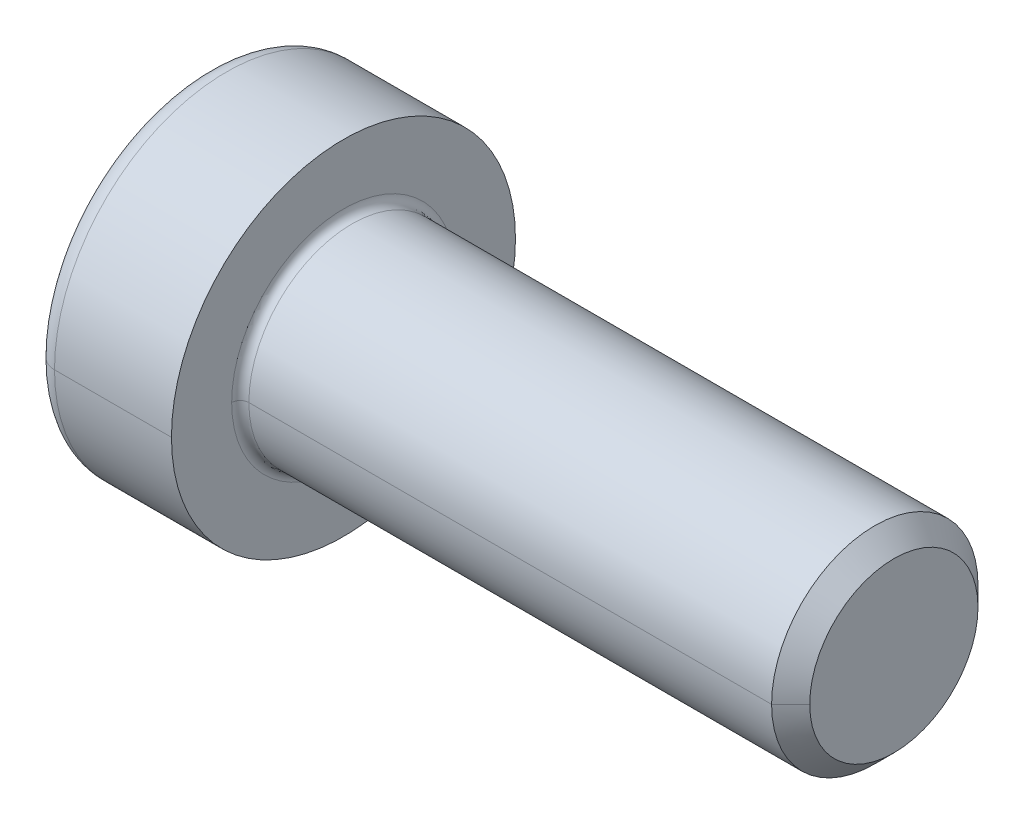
ISO-10303-21;
HEADER;
FILE_DESCRIPTION(('STEP AP214'),'2;1');
FILE_NAME('part.step','',(''),(''),'','','');
FILE_SCHEMA(('AUTOMOTIVE_DESIGN { 1 0 10303 214 1 1 1 1 }'));
ENDSEC;
DATA;
#1=APPLICATION_CONTEXT('core data for automotive mechanical design processes');
#2=APPLICATION_PROTOCOL_DEFINITION('international standard','automotive_design',2000,#1);
#3=PRODUCT_CONTEXT('',#1,'mechanical');
#4=PRODUCT('Part','Part','',(#3));
#5=PRODUCT_RELATED_PRODUCT_CATEGORY('part','',(#4));
#6=PRODUCT_DEFINITION_FORMATION('','',#4);
#7=PRODUCT_DEFINITION_CONTEXT('part definition',#1,'design');
#8=PRODUCT_DEFINITION('design','',#6,#7);
#9=PRODUCT_DEFINITION_SHAPE('','',#8);
#10=(LENGTH_UNIT() NAMED_UNIT(*) SI_UNIT(.MILLI.,.METRE.));
#11=(NAMED_UNIT(*) PLANE_ANGLE_UNIT() SI_UNIT($,.RADIAN.));
#12=(NAMED_UNIT(*) SI_UNIT($,.STERADIAN.) SOLID_ANGLE_UNIT());
#13=UNCERTAINTY_MEASURE_WITH_UNIT(LENGTH_MEASURE(1.E-05),#10,'distance_accuracy_value','');
#14=(GEOMETRIC_REPRESENTATION_CONTEXT(3) GLOBAL_UNCERTAINTY_ASSIGNED_CONTEXT((#13)) GLOBAL_UNIT_ASSIGNED_CONTEXT((#10,
#11,#12)) REPRESENTATION_CONTEXT('',''));
#15=CARTESIAN_POINT('',(0.,0.,0.));
#16=DIRECTION('',(0.,0.,1.));
#17=DIRECTION('',(1.,0.,0.));
#18=AXIS2_PLACEMENT_3D('',#15,#16,#17);
#19=CARTESIAN_POINT('',(-25.4127162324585,1.46192355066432,0.543791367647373));
#20=DIRECTION('',(-1.,0.,0.));
#21=DIRECTION('',(0.,0.,1.));
#22=AXIS2_PLACEMENT_3D('',#19,#20,#21);
#23=CONICAL_SURFACE('',#22,1.5,1.0471975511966);
#24=DIRECTION('',(-0.5,0.,-0.866025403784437));
#25=VECTOR('',#24,1.);
#26=CARTESIAN_POINT('',(-25.4127162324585,1.46192355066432,-0.956208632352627));
#27=LINE('',#26,#25);
#28=CARTESIAN_POINT('',(-24.546690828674,1.46192355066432,0.543791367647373));
#29=VERTEX_POINT('',#28);
#30=CARTESIAN_POINT('',(-25.4127162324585,1.46192355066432,-0.956208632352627));
#31=VERTEX_POINT('',#30);
#32=EDGE_CURVE('E449',#29,#31,#27,.T.);
#33=ORIENTED_EDGE('',*,*,#32,.F.);
#34=DIRECTION('',(-0.5,0.,0.866025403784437));
#35=VECTOR('',#34,1.);
#36=CARTESIAN_POINT('',(-25.4127162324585,1.46192355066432,2.04379136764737));
#37=LINE('',#36,#35);
#38=CARTESIAN_POINT('',(-25.4127162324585,1.46192355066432,2.04379136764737));
#39=VERTEX_POINT('',#38);
#40=EDGE_CURVE('E498',#29,#39,#37,.T.);
#41=ORIENTED_EDGE('',*,*,#40,.T.);
#42=CARTESIAN_POINT('',(-25.4127162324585,1.46192355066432,0.543791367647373));
#43=DIRECTION('',(-1.,0.,0.));
#44=DIRECTION('',(0.,0.,1.));
#45=AXIS2_PLACEMENT_3D('',#42,#43,#44);
#46=CIRCLE('',#45,1.5);
#47=EDGE_CURVE('E10',#39,#31,#46,.T.);
#48=ORIENTED_EDGE('',*,*,#47,.T.);
#49=EDGE_LOOP('',(#33,#41,#48));
#50=FACE_BOUND('',#49,.T.);
#51=ADVANCED_FACE('F15',(#50),#23,.F.);
#52=CARTESIAN_POINT('',(-30.4127162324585,1.46192355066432,0.543791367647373));
#53=DIRECTION('',(-1.,0.,0.));
#54=DIRECTION('',(0.,0.,1.));
#55=AXIS2_PLACEMENT_3D('',#52,#53,#54);
#56=CYLINDRICAL_SURFACE('',#55,1.5);
#57=DIRECTION('',(-1.,0.,0.));
#58=VECTOR('',#57,1.);
#59=CARTESIAN_POINT('',(-30.4127162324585,1.46192355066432,-0.956208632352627));
#60=LINE('',#59,#58);
#61=CARTESIAN_POINT('',(-27.3353659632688,1.46192355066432,-0.956208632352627));
#62=VERTEX_POINT('',#61);
#63=EDGE_CURVE('E251',#31,#62,#60,.T.);
#64=ORIENTED_EDGE('',*,*,#63,.F.);
#65=ORIENTED_EDGE('',*,*,#47,.F.);
#66=DIRECTION('',(-1.,0.,0.));
#67=VECTOR('',#66,1.);
#68=CARTESIAN_POINT('',(-30.4127162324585,1.46192355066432,2.04379136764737));
#69=LINE('',#68,#67);
#70=CARTESIAN_POINT('',(-27.3353659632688,1.46192355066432,2.04379136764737));
#71=VERTEX_POINT('',#70);
#72=EDGE_CURVE('E250',#39,#71,#69,.T.);
#73=ORIENTED_EDGE('',*,*,#72,.T.);
#74=CARTESIAN_POINT('',(-27.3353659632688,1.46192355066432,0.543791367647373));
#75=DIRECTION('',(-1.,0.,0.));
#76=DIRECTION('',(0.,0.,1.));
#77=AXIS2_PLACEMENT_3D('',#74,#75,#76);
#78=CIRCLE('',#77,1.5);
#79=EDGE_CURVE('E18',#71,#62,#78,.T.);
#80=ORIENTED_EDGE('',*,*,#79,.T.);
#81=EDGE_LOOP('',(#64,#65,#73,#80));
#82=FACE_BOUND('',#81,.T.);
#83=ADVANCED_FACE('F491',(#82),#56,.F.);
#84=CARTESIAN_POINT('',(-27.9127162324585,1.46192355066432,0.543791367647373));
#85=DIRECTION('',(-1.,0.,0.));
#86=DIRECTION('',(0.,0.,1.));
#87=AXIS2_PLACEMENT_3D('',#84,#85,#86);
#88=CONICAL_SURFACE('',#87,2.5,1.0471975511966);
#89=DIRECTION('',(-0.5,0.,-0.866025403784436));
#90=VECTOR('',#89,1.);
#91=CARTESIAN_POINT('',(-27.9127162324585,1.46192355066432,-1.95620863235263));
#92=LINE('',#91,#90);
#93=CARTESIAN_POINT('',(-27.9127162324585,1.46192355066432,-1.95620863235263));
#94=VERTEX_POINT('',#93);
#95=EDGE_CURVE('E260',#62,#94,#92,.T.);
#96=ORIENTED_EDGE('',*,*,#95,.F.);
#97=ORIENTED_EDGE('',*,*,#79,.F.);
#98=DIRECTION('',(-0.5,0.,0.866025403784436));
#99=VECTOR('',#98,1.);
#100=CARTESIAN_POINT('',(-27.9127162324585,1.46192355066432,3.04379136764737));
#101=LINE('',#100,#99);
#102=CARTESIAN_POINT('',(-27.9127162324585,1.46192355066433,3.04379136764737));
#103=VERTEX_POINT('',#102);
#104=EDGE_CURVE('E221',#71,#103,#101,.T.);
#105=ORIENTED_EDGE('',*,*,#104,.T.);
#106=CARTESIAN_POINT('',(-27.9127162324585,1.46192355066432,0.543791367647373));
#107=DIRECTION('',(-1.,0.,0.));
#108=DIRECTION('',(0.,0.,1.));
#109=AXIS2_PLACEMENT_3D('',#106,#107,#108);
#110=CIRCLE('',#109,2.5);
#111=CARTESIAN_POINT('',(-27.9127162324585,3.62698706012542,1.79379136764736));
#112=VERTEX_POINT('',#111);
#113=EDGE_CURVE('E210',#103,#112,#110,.T.);
#114=ORIENTED_EDGE('',*,*,#113,.T.);
#115=CARTESIAN_POINT('',(-27.9127162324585,1.46192355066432,0.543791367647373));
#116=DIRECTION('',(-1.,0.,0.));
#117=DIRECTION('',(0.,0.,1.));
#118=AXIS2_PLACEMENT_3D('',#115,#116,#117);
#119=CIRCLE('',#118,2.5);
#120=CARTESIAN_POINT('',(-27.9127162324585,3.62698706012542,-0.70620863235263));
#121=VERTEX_POINT('',#120);
#122=EDGE_CURVE('E355',#112,#121,#119,.T.);
#123=ORIENTED_EDGE('',*,*,#122,.T.);
#124=CARTESIAN_POINT('',(-27.9127162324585,1.46192355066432,0.543791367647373));
#125=DIRECTION('',(-1.,0.,0.));
#126=DIRECTION('',(0.,0.,1.));
#127=AXIS2_PLACEMENT_3D('',#124,#125,#126);
#128=CIRCLE('',#127,2.5);
#129=EDGE_CURVE('E298',#121,#94,#128,.T.);
#130=ORIENTED_EDGE('',*,*,#129,.T.);
#131=EDGE_LOOP('',(#96,#97,#105,#114,#123,#130));
#132=FACE_BOUND('',#131,.T.);
#133=ADVANCED_FACE('F223',(#132),#88,.F.);
#134=CARTESIAN_POINT('',(-27.9127162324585,2.9052992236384,3.04379136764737));
#135=DIRECTION('',(-1.,0.,0.));
#136=DIRECTION('',(0.,0.,1.));
#137=AXIS2_PLACEMENT_3D('',#134,#135,#136);
#138=PLANE('',#137);
#139=CARTESIAN_POINT('',(-27.9127162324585,1.46192355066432,0.543791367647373));
#140=DIRECTION('',(-1.,0.,0.));
#141=DIRECTION('',(0.,0.,1.));
#142=AXIS2_PLACEMENT_3D('',#139,#140,#141);
#143=CIRCLE('',#142,2.5);
#144=CARTESIAN_POINT('',(-27.9127162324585,-0.703139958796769,1.79379136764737));
#145=VERTEX_POINT('',#144);
#146=EDGE_CURVE('E192',#145,#103,#143,.T.);
#147=ORIENTED_EDGE('',*,*,#146,.F.);
#148=DIRECTION('',(0.,-0.5,-0.866025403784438));
#149=VECTOR('',#148,1.);
#150=CARTESIAN_POINT('',(-27.9127162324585,0.0185478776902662,3.04379136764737));
#151=LINE('',#150,#149);
#152=CARTESIAN_POINT('',(-27.9127162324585,0.0185478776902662,3.04379136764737));
#153=VERTEX_POINT('',#152);
#154=EDGE_CURVE('E37',#153,#145,#151,.T.);
#155=ORIENTED_EDGE('',*,*,#154,.F.);
#156=DIRECTION('',(0.,1.,0.));
#157=VECTOR('',#156,1.);
#158=CARTESIAN_POINT('',(-27.9127162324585,0.0185478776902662,3.04379136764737));
#159=LINE('',#158,#157);
#160=EDGE_CURVE('E188',#153,#103,#159,.T.);
#161=ORIENTED_EDGE('',*,*,#160,.T.);
#162=EDGE_LOOP('',(#147,#155,#161));
#163=FACE_BOUND('',#162,.T.);
#164=ADVANCED_FACE('F190',(#163),#138,.T.);
#165=CARTESIAN_POINT('',(-27.9127162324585,4.34867489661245,0.543791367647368));
#166=DIRECTION('',(0.,0.866025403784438,-0.5));
#167=DIRECTION('',(-1.,0.,0.));
#168=AXIS2_PLACEMENT_3D('',#165,#166,#167);
#169=PLANE('',#168);
#170=DIRECTION('',(0.,-0.5,-0.866025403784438));
#171=VECTOR('',#170,1.);
#172=CARTESIAN_POINT('',(-27.9127162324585,4.34867489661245,0.543791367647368));
#173=LINE('',#172,#171);
#174=CARTESIAN_POINT('',(-27.9127162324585,2.90529922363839,-1.95620863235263));
#175=VERTEX_POINT('',#174);
#176=EDGE_CURVE('E294',#121,#175,#173,.T.);
#177=ORIENTED_EDGE('',*,*,#176,.F.);
#178=DIRECTION('',(0.,-0.5,-0.866025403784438));
#179=VECTOR('',#178,1.);
#180=CARTESIAN_POINT('',(-27.9127162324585,4.34867489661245,0.543791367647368));
#181=LINE('',#180,#179);
#182=CARTESIAN_POINT('',(-27.9127162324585,4.34867489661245,0.543791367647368));
#183=VERTEX_POINT('',#182);
#184=EDGE_CURVE('E324',#183,#121,#181,.T.);
#185=ORIENTED_EDGE('',*,*,#184,.F.);
#186=DIRECTION('',(-1.,0.,0.));
#187=VECTOR('',#186,1.);
#188=CARTESIAN_POINT('',(-27.9127162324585,4.34867489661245,0.543791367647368));
#189=LINE('',#188,#187);
#190=CARTESIAN_POINT('',(-30.4127162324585,4.34867489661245,0.543791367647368));
#191=VERTEX_POINT('',#190);
#192=EDGE_CURVE('E197',#183,#191,#189,.T.);
#193=ORIENTED_EDGE('',*,*,#192,.T.);
#194=DIRECTION('',(0.,-0.5,-0.866025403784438));
#195=VECTOR('',#194,1.);
#196=CARTESIAN_POINT('',(-30.4127162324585,4.34867489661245,0.543791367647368));
#197=LINE('',#196,#195);
#198=CARTESIAN_POINT('',(-30.4127162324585,2.90529922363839,-1.95620863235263));
#199=VERTEX_POINT('',#198);
#200=EDGE_CURVE('E283',#191,#199,#197,.T.);
#201=ORIENTED_EDGE('',*,*,#200,.T.);
#202=DIRECTION('',(-1.,0.,0.));
#203=VECTOR('',#202,1.);
#204=CARTESIAN_POINT('',(-27.9127162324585,2.90529922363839,-1.95620863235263));
#205=LINE('',#204,#203);
#206=EDGE_CURVE('E266',#175,#199,#205,.T.);
#207=ORIENTED_EDGE('',*,*,#206,.F.);
#208=EDGE_LOOP('',(#177,#185,#193,#201,#207));
#209=FACE_BOUND('',#208,.T.);
#210=ADVANCED_FACE('F839',(#209),#169,.F.);
#211=CARTESIAN_POINT('',(-27.9127162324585,2.90529922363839,-1.95620863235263));
#212=DIRECTION('',(0.,0.,-1.));
#213=DIRECTION('',(0.,-1.,0.));
#214=AXIS2_PLACEMENT_3D('',#211,#212,#213);
#215=PLANE('',#214);
#216=DIRECTION('',(0.,-1.,0.));
#217=VECTOR('',#216,1.);
#218=CARTESIAN_POINT('',(-27.9127162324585,2.90529922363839,-1.95620863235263));
#219=LINE('',#218,#217);
#220=CARTESIAN_POINT('',(-27.9127162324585,0.0185478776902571,-1.95620863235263));
#221=VERTEX_POINT('',#220);
#222=EDGE_CURVE('E367',#94,#221,#219,.T.);
#223=ORIENTED_EDGE('',*,*,#222,.F.);
#224=DIRECTION('',(0.,-1.,0.));
#225=VECTOR('',#224,1.);
#226=CARTESIAN_POINT('',(-27.9127162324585,2.90529922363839,-1.95620863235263));
#227=LINE('',#226,#225);
#228=EDGE_CURVE('E297',#175,#94,#227,.T.);
#229=ORIENTED_EDGE('',*,*,#228,.F.);
#230=ORIENTED_EDGE('',*,*,#206,.T.);
#231=DIRECTION('',(0.,-1.,0.));
#232=VECTOR('',#231,1.);
#233=CARTESIAN_POINT('',(-30.4127162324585,2.90529922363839,-1.95620863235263));
#234=LINE('',#233,#232);
#235=CARTESIAN_POINT('',(-30.4127162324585,0.0185478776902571,-1.95620863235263));
#236=VERTEX_POINT('',#235);
#237=EDGE_CURVE('E271',#199,#236,#234,.T.);
#238=ORIENTED_EDGE('',*,*,#237,.T.);
#239=DIRECTION('',(-1.,0.,0.));
#240=VECTOR('',#239,1.);
#241=CARTESIAN_POINT('',(-27.9127162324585,0.0185478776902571,-1.95620863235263));
#242=LINE('',#241,#240);
#243=EDGE_CURVE('E48',#221,#236,#242,.T.);
#244=ORIENTED_EDGE('',*,*,#243,.F.);
#245=EDGE_LOOP('',(#223,#229,#230,#238,#244));
#246=FACE_BOUND('',#245,.T.);
#247=ADVANCED_FACE('F835',(#246),#215,.F.);
#248=CARTESIAN_POINT('',(-27.9127162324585,-1.4248277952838,0.543791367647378));
#249=DIRECTION('',(0.,0.86602540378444,0.5));
#250=DIRECTION('',(1.,0.,0.));
#251=AXIS2_PLACEMENT_3D('',#248,#249,#250);
#252=PLANE('',#251);
#253=ORIENTED_EDGE('',*,*,#243,.T.);
#254=DIRECTION('',(0.,0.5,-0.86602540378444));
#255=VECTOR('',#254,1.);
#256=CARTESIAN_POINT('',(-30.4127162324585,-1.4248277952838,0.543791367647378));
#257=LINE('',#256,#255);
#258=CARTESIAN_POINT('',(-30.4127162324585,-1.4248277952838,0.543791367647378));
#259=VERTEX_POINT('',#258);
#260=EDGE_CURVE('E352',#259,#236,#257,.T.);
#261=ORIENTED_EDGE('',*,*,#260,.F.);
#262=DIRECTION('',(-1.,0.,0.));
#263=VECTOR('',#262,1.);
#264=CARTESIAN_POINT('',(-27.9127162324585,-1.4248277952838,0.543791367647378));
#265=LINE('',#264,#263);
#266=CARTESIAN_POINT('',(-27.9127162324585,-1.4248277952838,0.543791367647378));
#267=VERTEX_POINT('',#266);
#268=EDGE_CURVE('E339',#267,#259,#265,.T.);
#269=ORIENTED_EDGE('',*,*,#268,.F.);
#270=DIRECTION('',(0.,0.5,-0.86602540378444));
#271=VECTOR('',#270,1.);
#272=CARTESIAN_POINT('',(-27.9127162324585,-1.4248277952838,0.543791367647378));
#273=LINE('',#272,#271);
#274=CARTESIAN_POINT('',(-27.9127162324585,-0.703139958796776,-0.706208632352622));
#275=VERTEX_POINT('',#274);
#276=EDGE_CURVE('E371',#267,#275,#273,.T.);
#277=ORIENTED_EDGE('',*,*,#276,.T.);
#278=DIRECTION('',(0.,0.5,-0.86602540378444));
#279=VECTOR('',#278,1.);
#280=CARTESIAN_POINT('',(-27.9127162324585,-1.4248277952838,0.543791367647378));
#281=LINE('',#280,#279);
#282=EDGE_CURVE('E368',#275,#221,#281,.T.);
#283=ORIENTED_EDGE('',*,*,#282,.T.);
#284=EDGE_LOOP('',(#253,#261,#269,#277,#283));
#285=FACE_BOUND('',#284,.T.);
#286=ADVANCED_FACE('F765',(#285),#252,.T.);
#287=CARTESIAN_POINT('',(-27.9127162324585,0.0185478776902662,3.04379136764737));
#288=DIRECTION('',(0.,0.866025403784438,-0.5));
#289=DIRECTION('',(-1.,0.,0.));
#290=AXIS2_PLACEMENT_3D('',#287,#288,#289);
#291=PLANE('',#290);
#292=ORIENTED_EDGE('',*,*,#268,.T.);
#293=DIRECTION('',(0.,-0.5,-0.866025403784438));
#294=VECTOR('',#293,1.);
#295=CARTESIAN_POINT('',(-30.4127162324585,0.0185478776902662,3.04379136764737));
#296=LINE('',#295,#294);
#297=CARTESIAN_POINT('',(-30.4127162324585,0.0185478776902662,3.04379136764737));
#298=VERTEX_POINT('',#297);
#299=EDGE_CURVE('E389',#298,#259,#296,.T.);
#300=ORIENTED_EDGE('',*,*,#299,.F.);
#301=DIRECTION('',(-1.,0.,0.));
#302=VECTOR('',#301,1.);
#303=CARTESIAN_POINT('',(-27.9127162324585,0.0185478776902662,3.04379136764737));
#304=LINE('',#303,#302);
#305=EDGE_CURVE('E196',#153,#298,#304,.T.);
#306=ORIENTED_EDGE('',*,*,#305,.F.);
#307=ORIENTED_EDGE('',*,*,#154,.T.);
#308=DIRECTION('',(0.,-0.5,-0.866025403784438));
#309=VECTOR('',#308,1.);
#310=CARTESIAN_POINT('',(-27.9127162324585,0.0185478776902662,3.04379136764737));
#311=LINE('',#310,#309);
#312=EDGE_CURVE('E376',#145,#267,#311,.T.);
#313=ORIENTED_EDGE('',*,*,#312,.T.);
#314=EDGE_LOOP('',(#292,#300,#306,#307,#313));
#315=FACE_BOUND('',#314,.T.);
#316=ADVANCED_FACE('F414',(#315),#291,.T.);
#317=CARTESIAN_POINT('',(-27.9127162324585,0.0185478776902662,3.04379136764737));
#318=DIRECTION('',(0.,0.,1.));
#319=DIRECTION('',(0.,-1.,0.));
#320=AXIS2_PLACEMENT_3D('',#317,#318,#319);
#321=PLANE('',#320);
#322=DIRECTION('',(0.,1.,0.));
#323=VECTOR('',#322,1.);
#324=CARTESIAN_POINT('',(-27.9127162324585,0.0185478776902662,3.04379136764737));
#325=LINE('',#324,#323);
#326=CARTESIAN_POINT('',(-27.9127162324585,2.9052992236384,3.04379136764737));
#327=VERTEX_POINT('',#326);
#328=EDGE_CURVE('E200',#103,#327,#325,.T.);
#329=ORIENTED_EDGE('',*,*,#328,.F.);
#330=ORIENTED_EDGE('',*,*,#160,.F.);
#331=ORIENTED_EDGE('',*,*,#305,.T.);
#332=DIRECTION('',(0.,1.,0.));
#333=VECTOR('',#332,1.);
#334=CARTESIAN_POINT('',(-30.4127162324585,0.0185478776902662,3.04379136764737));
#335=LINE('',#334,#333);
#336=CARTESIAN_POINT('',(-30.4127162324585,2.9052992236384,3.04379136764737));
#337=VERTEX_POINT('',#336);
#338=EDGE_CURVE('E282',#298,#337,#335,.T.);
#339=ORIENTED_EDGE('',*,*,#338,.T.);
#340=DIRECTION('',(-1.,0.,0.));
#341=VECTOR('',#340,1.);
#342=CARTESIAN_POINT('',(-27.9127162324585,2.9052992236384,3.04379136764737));
#343=LINE('',#342,#341);
#344=EDGE_CURVE('E204',#327,#337,#343,.T.);
#345=ORIENTED_EDGE('',*,*,#344,.F.);
#346=EDGE_LOOP('',(#329,#330,#331,#339,#345));
#347=FACE_BOUND('',#346,.T.);
#348=ADVANCED_FACE('F202',(#347),#321,.F.);
#349=CARTESIAN_POINT('',(-27.9127162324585,4.34867489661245,0.543791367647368));
#350=DIRECTION('',(0.,-0.86602540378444,-0.5));
#351=DIRECTION('',(0.,0.5,-0.86602540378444));
#352=AXIS2_PLACEMENT_3D('',#349,#350,#351);
#353=PLANE('',#352);
#354=ORIENTED_EDGE('',*,*,#344,.T.);
#355=DIRECTION('',(0.,-0.5,0.86602540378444));
#356=VECTOR('',#355,1.);
#357=CARTESIAN_POINT('',(-30.4127162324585,4.34867489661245,0.543791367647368));
#358=LINE('',#357,#356);
#359=EDGE_CURVE('E278',#191,#337,#358,.T.);
#360=ORIENTED_EDGE('',*,*,#359,.F.);
#361=ORIENTED_EDGE('',*,*,#192,.F.);
#362=DIRECTION('',(0.,-0.5,0.86602540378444));
#363=VECTOR('',#362,1.);
#364=CARTESIAN_POINT('',(-27.9127162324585,4.34867489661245,0.543791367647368));
#365=LINE('',#364,#363);
#366=EDGE_CURVE('E358',#183,#112,#365,.T.);
#367=ORIENTED_EDGE('',*,*,#366,.T.);
#368=DIRECTION('',(0.,-0.5,0.86602540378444));
#369=VECTOR('',#368,1.);
#370=CARTESIAN_POINT('',(-27.9127162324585,4.34867489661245,0.543791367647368));
#371=LINE('',#370,#369);
#372=EDGE_CURVE('E209',#112,#327,#371,.T.);
#373=ORIENTED_EDGE('',*,*,#372,.T.);
#374=EDGE_LOOP('',(#354,#360,#361,#367,#373));
#375=FACE_BOUND('',#374,.T.);
#376=ADVANCED_FACE('F422',(#375),#353,.T.);
#377=CARTESIAN_POINT('',(-29.8127162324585,1.46192355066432,0.543791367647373));
#378=DIRECTION('',(-1.,0.,0.));
#379=DIRECTION('',(0.,0.,1.));
#380=AXIS2_PLACEMENT_3D('',#377,#378,#379);
#381=TOROIDAL_SURFACE('',#380,4.4,0.6);
#382=CARTESIAN_POINT('',(-29.8127162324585,1.46192355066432,-3.85620863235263));
#383=DIRECTION('',(0.,1.,0.));
#384=DIRECTION('',(0.,0.,1.));
#385=AXIS2_PLACEMENT_3D('',#382,#383,#384);
#386=CIRCLE('',#385,0.6);
#387=CARTESIAN_POINT('',(-29.8127162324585,1.46192355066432,-4.45620863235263));
#388=VERTEX_POINT('',#387);
#389=CARTESIAN_POINT('',(-30.4127162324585,1.46192355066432,-3.85620863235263));
#390=VERTEX_POINT('',#389);
#391=EDGE_CURVE('E284',#388,#390,#386,.T.);
#392=ORIENTED_EDGE('',*,*,#391,.F.);
#393=CARTESIAN_POINT('',(-29.8127162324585,1.46192355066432,0.543791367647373));
#394=DIRECTION('',(1.,0.,0.));
#395=DIRECTION('',(0.,0.,1.));
#396=AXIS2_PLACEMENT_3D('',#393,#394,#395);
#397=CIRCLE('',#396,5.);
#398=CARTESIAN_POINT('',(-29.8127162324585,1.46192355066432,5.54379136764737));
#399=VERTEX_POINT('',#398);
#400=EDGE_CURVE('E270',#399,#388,#397,.T.);
#401=ORIENTED_EDGE('',*,*,#400,.F.);
#402=CARTESIAN_POINT('',(-29.8127162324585,1.46192355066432,4.94379136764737));
#403=DIRECTION('',(0.,-1.,0.));
#404=DIRECTION('',(0.,0.,-1.));
#405=AXIS2_PLACEMENT_3D('',#402,#403,#404);
#406=CIRCLE('',#405,0.6);
#407=CARTESIAN_POINT('',(-30.4127162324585,1.46192355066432,4.94379136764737));
#408=VERTEX_POINT('',#407);
#409=EDGE_CURVE('E272',#399,#408,#406,.T.);
#410=ORIENTED_EDGE('',*,*,#409,.T.);
#411=CARTESIAN_POINT('',(-30.4127162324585,1.46192355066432,0.543791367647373));
#412=DIRECTION('',(-1.,0.,0.));
#413=DIRECTION('',(0.,0.,1.));
#414=AXIS2_PLACEMENT_3D('',#411,#412,#413);
#415=CIRCLE('',#414,4.4);
#416=EDGE_CURVE('E381',#390,#408,#415,.T.);
#417=ORIENTED_EDGE('',*,*,#416,.F.);
#418=EDGE_LOOP('',(#392,#401,#410,#417));
#419=FACE_BOUND('',#418,.T.);
#420=ADVANCED_FACE('F466',(#419),#381,.T.);
#421=CARTESIAN_POINT('',(-26.1627162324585,1.46192355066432,0.543791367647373));
#422=DIRECTION('',(1.,0.,0.));
#423=DIRECTION('',(0.,0.,-1.));
#424=AXIS2_PLACEMENT_3D('',#421,#422,#423);
#425=TOROIDAL_SURFACE('',#424,3.25,0.25);
#426=CARTESIAN_POINT('',(-26.1627162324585,1.46192355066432,3.79379136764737));
#427=DIRECTION('',(0.,1.,0.));
#428=DIRECTION('',(0.,0.,1.));
#429=AXIS2_PLACEMENT_3D('',#426,#427,#428);
#430=CIRCLE('',#429,0.25);
#431=CARTESIAN_POINT('',(-26.1627162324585,1.46192355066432,3.54379136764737));
#432=VERTEX_POINT('',#431);
#433=CARTESIAN_POINT('',(-26.4127162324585,1.46192355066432,3.79379136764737));
#434=VERTEX_POINT('',#433);
#435=EDGE_CURVE('E314',#432,#434,#430,.T.);
#436=ORIENTED_EDGE('',*,*,#435,.F.);
#437=CARTESIAN_POINT('',(-26.1627162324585,1.46192355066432,0.543791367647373));
#438=DIRECTION('',(1.,0.,0.));
#439=DIRECTION('',(0.,0.,-1.));
#440=AXIS2_PLACEMENT_3D('',#437,#438,#439);
#441=CIRCLE('',#440,3.);
#442=CARTESIAN_POINT('',(-26.1627162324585,1.46192355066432,-2.45620863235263));
#443=VERTEX_POINT('',#442);
#444=EDGE_CURVE('E256',#443,#432,#441,.T.);
#445=ORIENTED_EDGE('',*,*,#444,.F.);
#446=CARTESIAN_POINT('',(-26.1627162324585,1.46192355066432,-2.70620863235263));
#447=DIRECTION('',(0.,-1.,0.));
#448=DIRECTION('',(0.,0.,-1.));
#449=AXIS2_PLACEMENT_3D('',#446,#447,#448);
#450=CIRCLE('',#449,0.25);
#451=CARTESIAN_POINT('',(-26.4127162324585,1.46192355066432,-2.70620863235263));
#452=VERTEX_POINT('',#451);
#453=EDGE_CURVE('E305',#443,#452,#450,.T.);
#454=ORIENTED_EDGE('',*,*,#453,.T.);
#455=CARTESIAN_POINT('',(-26.4127162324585,1.46192355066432,0.543791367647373));
#456=DIRECTION('',(-1.,0.,0.));
#457=DIRECTION('',(0.,0.,-1.));
#458=AXIS2_PLACEMENT_3D('',#455,#456,#457);
#459=CIRCLE('',#458,3.25);
#460=EDGE_CURVE('E398',#434,#452,#459,.T.);
#461=ORIENTED_EDGE('',*,*,#460,.F.);
#462=EDGE_LOOP('',(#436,#445,#454,#461));
#463=FACE_BOUND('',#462,.T.);
#464=ADVANCED_FACE('F905',(#463),#425,.F.);
#465=CARTESIAN_POINT('',(-10.4127162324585,3.90742355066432,0.543791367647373));
#466=DIRECTION('',(1.,0.,0.));
#467=DIRECTION('',(0.,1.,0.));
#468=AXIS2_PLACEMENT_3D('',#465,#466,#467);
#469=PLANE('',#468);
#470=CARTESIAN_POINT('',(-10.4127162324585,1.46192355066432,0.543791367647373));
#471=DIRECTION('',(-1.,0.,0.));
#472=DIRECTION('',(0.,0.,1.));
#473=AXIS2_PLACEMENT_3D('',#470,#471,#472);
#474=CIRCLE('',#473,2.4455);
#475=CARTESIAN_POINT('',(-10.4127162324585,1.46192355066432,2.98929136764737));
#476=VERTEX_POINT('',#475);
#477=CARTESIAN_POINT('',(-10.4127162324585,1.46192355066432,-1.90170863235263));
#478=VERTEX_POINT('',#477);
#479=EDGE_CURVE('E309',#476,#478,#474,.T.);
#480=ORIENTED_EDGE('',*,*,#479,.F.);
#481=CARTESIAN_POINT('',(-10.4127162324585,1.46192355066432,0.543791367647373));
#482=DIRECTION('',(-1.,0.,0.));
#483=DIRECTION('',(0.,0.,1.));
#484=AXIS2_PLACEMENT_3D('',#481,#482,#483);
#485=CIRCLE('',#484,2.4455);
#486=EDGE_CURVE('E290',#478,#476,#485,.T.);
#487=ORIENTED_EDGE('',*,*,#486,.F.);
#488=EDGE_LOOP('',(#480,#487));
#489=FACE_BOUND('',#488,.T.);
#490=ADVANCED_FACE('F796',(#489),#469,.T.);
#491=CARTESIAN_POINT('',(-10.4127162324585,1.46192355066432,0.543791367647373));
#492=DIRECTION('',(-1.,0.,0.));
#493=DIRECTION('',(0.,0.,1.));
#494=AXIS2_PLACEMENT_3D('',#491,#492,#493);
#495=CONICAL_SURFACE('',#494,2.4455,0.785398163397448);
#496=DIRECTION('',(-0.707106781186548,0.,-0.707106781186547));
#497=VECTOR('',#496,1.);
#498=CARTESIAN_POINT('',(-10.4127162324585,1.46192355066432,-1.90170863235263));
#499=LINE('',#498,#497);
#500=CARTESIAN_POINT('',(-10.9672162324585,1.46192355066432,-2.45620863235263));
#501=VERTEX_POINT('',#500);
#502=EDGE_CURVE('E328',#478,#501,#499,.T.);
#503=ORIENTED_EDGE('',*,*,#502,.F.);
#504=ORIENTED_EDGE('',*,*,#486,.T.);
#505=DIRECTION('',(-0.707106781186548,0.,0.707106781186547));
#506=VECTOR('',#505,1.);
#507=CARTESIAN_POINT('',(-10.4127162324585,1.46192355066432,2.98929136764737));
#508=LINE('',#507,#506);
#509=CARTESIAN_POINT('',(-10.9672162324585,1.46192355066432,3.54379136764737));
#510=VERTEX_POINT('',#509);
#511=EDGE_CURVE('E257',#476,#510,#508,.T.);
#512=ORIENTED_EDGE('',*,*,#511,.T.);
#513=CARTESIAN_POINT('',(-10.9672162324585,1.46192355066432,0.543791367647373));
#514=DIRECTION('',(-1.,0.,0.));
#515=DIRECTION('',(0.,0.,1.));
#516=AXIS2_PLACEMENT_3D('',#513,#514,#515);
#517=CIRCLE('',#516,3.);
#518=EDGE_CURVE('E293',#501,#510,#517,.T.);
#519=ORIENTED_EDGE('',*,*,#518,.F.);
#520=EDGE_LOOP('',(#503,#504,#512,#519));
#521=FACE_BOUND('',#520,.T.);
#522=ADVANCED_FACE('F486',(#521),#495,.T.);
#523=CARTESIAN_POINT('',(-62.1627162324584,1.46192355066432,0.543791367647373));
#524=DIRECTION('',(-1.,0.,0.));
#525=DIRECTION('',(0.,0.,1.));
#526=AXIS2_PLACEMENT_3D('',#523,#524,#525);
#527=CYLINDRICAL_SURFACE('',#526,3.);
#528=DIRECTION('',(-1.,0.,0.));
#529=VECTOR('',#528,1.);
#530=CARTESIAN_POINT('',(-62.1627162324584,1.46192355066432,-2.45620863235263));
#531=LINE('',#530,#529);
#532=EDGE_CURVE('E252',#501,#443,#531,.T.);
#533=ORIENTED_EDGE('',*,*,#532,.F.);
#534=ORIENTED_EDGE('',*,*,#518,.T.);
#535=DIRECTION('',(-1.,0.,0.));
#536=VECTOR('',#535,1.);
#537=CARTESIAN_POINT('',(-62.1627162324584,1.46192355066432,3.54379136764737));
#538=LINE('',#537,#536);
#539=EDGE_CURVE('E244',#510,#432,#538,.T.);
#540=ORIENTED_EDGE('',*,*,#539,.T.);
#541=CARTESIAN_POINT('',(-26.1627162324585,1.46192355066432,0.543791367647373));
#542=DIRECTION('',(1.,0.,0.));
#543=DIRECTION('',(0.,0.,-1.));
#544=AXIS2_PLACEMENT_3D('',#541,#542,#543);
#545=CIRCLE('',#544,3.);
#546=EDGE_CURVE('E276',#432,#443,#545,.T.);
#547=ORIENTED_EDGE('',*,*,#546,.T.);
#548=EDGE_LOOP('',(#533,#534,#540,#547));
#549=FACE_BOUND('',#548,.T.);
#550=ADVANCED_FACE('F477',(#549),#527,.T.);
#551=CARTESIAN_POINT('',(-26.4127162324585,6.46192355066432,0.543791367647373));
#552=DIRECTION('',(1.,0.,0.));
#553=DIRECTION('',(0.,1.,0.));
#554=AXIS2_PLACEMENT_3D('',#551,#552,#553);
#555=PLANE('',#554);
#556=CARTESIAN_POINT('',(-26.4127162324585,1.46192355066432,0.543791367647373));
#557=DIRECTION('',(-1.,0.,0.));
#558=DIRECTION('',(0.,0.,-1.));
#559=AXIS2_PLACEMENT_3D('',#556,#557,#558);
#560=CIRCLE('',#559,3.25);
#561=EDGE_CURVE('E310',#452,#434,#560,.T.);
#562=ORIENTED_EDGE('',*,*,#561,.T.);
#563=ORIENTED_EDGE('',*,*,#460,.T.);
#564=EDGE_LOOP('',(#562,#563));
#565=FACE_BOUND('',#564,.T.);
#566=CARTESIAN_POINT('',(-26.4127162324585,1.46192355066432,0.543791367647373));
#567=DIRECTION('',(-1.,0.,0.));
#568=DIRECTION('',(0.,0.,1.));
#569=AXIS2_PLACEMENT_3D('',#566,#567,#568);
#570=CIRCLE('',#569,5.);
#571=CARTESIAN_POINT('',(-26.4127162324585,1.46192355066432,5.54379136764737));
#572=VERTEX_POINT('',#571);
#573=CARTESIAN_POINT('',(-26.4127162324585,1.46192355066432,-4.45620863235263));
#574=VERTEX_POINT('',#573);
#575=EDGE_CURVE('E329',#572,#574,#570,.T.);
#576=ORIENTED_EDGE('',*,*,#575,.F.);
#577=CARTESIAN_POINT('',(-26.4127162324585,1.46192355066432,0.543791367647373));
#578=DIRECTION('',(-1.,0.,0.));
#579=DIRECTION('',(0.,0.,1.));
#580=AXIS2_PLACEMENT_3D('',#577,#578,#579);
#581=CIRCLE('',#580,5.);
#582=EDGE_CURVE('E267',#574,#572,#581,.T.);
#583=ORIENTED_EDGE('',*,*,#582,.F.);
#584=EDGE_LOOP('',(#576,#583));
#585=FACE_BOUND('',#584,.T.);
#586=ADVANCED_FACE('F475',(#565,#585),#555,.T.);
#587=CARTESIAN_POINT('',(-62.1627162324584,1.46192355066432,0.543791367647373));
#588=DIRECTION('',(-1.,0.,0.));
#589=DIRECTION('',(0.,0.,1.));
#590=AXIS2_PLACEMENT_3D('',#587,#588,#589);
#591=CYLINDRICAL_SURFACE('',#590,5.);
#592=DIRECTION('',(-1.,0.,0.));
#593=VECTOR('',#592,1.);
#594=CARTESIAN_POINT('',(-62.1627162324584,1.46192355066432,-4.45620863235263));
#595=LINE('',#594,#593);
#596=EDGE_CURVE('E333',#574,#388,#595,.T.);
#597=ORIENTED_EDGE('',*,*,#596,.F.);
#598=ORIENTED_EDGE('',*,*,#582,.T.);
#599=DIRECTION('',(-1.,0.,0.));
#600=VECTOR('',#599,1.);
#601=CARTESIAN_POINT('',(-62.1627162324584,1.46192355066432,5.54379136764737));
#602=LINE('',#601,#600);
#603=EDGE_CURVE('E218',#572,#399,#602,.T.);
#604=ORIENTED_EDGE('',*,*,#603,.T.);
#605=ORIENTED_EDGE('',*,*,#400,.T.);
#606=EDGE_LOOP('',(#597,#598,#604,#605));
#607=FACE_BOUND('',#606,.T.);
#608=ADVANCED_FACE('F473',(#607),#591,.T.);
#609=CARTESIAN_POINT('',(-30.4127162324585,1.46192355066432,0.543791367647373));
#610=DIRECTION('',(-1.,0.,0.));
#611=DIRECTION('',(0.,0.,1.));
#612=AXIS2_PLACEMENT_3D('',#609,#610,#611);
#613=PLANE('',#612);
#614=ORIENTED_EDGE('',*,*,#200,.F.);
#615=ORIENTED_EDGE('',*,*,#359,.T.);
#616=ORIENTED_EDGE('',*,*,#338,.F.);
#617=ORIENTED_EDGE('',*,*,#299,.T.);
#618=ORIENTED_EDGE('',*,*,#260,.T.);
#619=ORIENTED_EDGE('',*,*,#237,.F.);
#620=EDGE_LOOP('',(#614,#615,#616,#617,#618,#619));
#621=FACE_BOUND('',#620,.T.);
#622=CARTESIAN_POINT('',(-30.4127162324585,1.46192355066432,0.543791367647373));
#623=DIRECTION('',(-1.,0.,0.));
#624=DIRECTION('',(0.,0.,1.));
#625=AXIS2_PLACEMENT_3D('',#622,#623,#624);
#626=CIRCLE('',#625,4.4);
#627=EDGE_CURVE('E277',#408,#390,#626,.T.);
#628=ORIENTED_EDGE('',*,*,#627,.T.);
#629=ORIENTED_EDGE('',*,*,#416,.T.);
#630=EDGE_LOOP('',(#628,#629));
#631=FACE_BOUND('',#630,.T.);
#632=ADVANCED_FACE('F417',(#621,#631),#613,.T.);
#633=CARTESIAN_POINT('',(-27.9127162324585,2.9052992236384,3.04379136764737));
#634=DIRECTION('',(-1.,0.,0.));
#635=DIRECTION('',(0.,0.,1.));
#636=AXIS2_PLACEMENT_3D('',#633,#634,#635);
#637=PLANE('',#636);
#638=CARTESIAN_POINT('',(-27.9127162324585,1.46192355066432,0.543791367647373));
#639=DIRECTION('',(-1.,0.,0.));
#640=DIRECTION('',(0.,0.,1.));
#641=AXIS2_PLACEMENT_3D('',#638,#639,#640);
#642=CIRCLE('',#641,2.5);
#643=EDGE_CURVE('E233',#275,#145,#642,.T.);
#644=ORIENTED_EDGE('',*,*,#643,.F.);
#645=ORIENTED_EDGE('',*,*,#276,.F.);
#646=ORIENTED_EDGE('',*,*,#312,.F.);
#647=EDGE_LOOP('',(#644,#645,#646));
#648=FACE_BOUND('',#647,.T.);
#649=ADVANCED_FACE('F750',(#648),#637,.T.);
#650=CARTESIAN_POINT('',(-27.9127162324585,2.9052992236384,3.04379136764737));
#651=DIRECTION('',(-1.,0.,0.));
#652=DIRECTION('',(0.,0.,1.));
#653=AXIS2_PLACEMENT_3D('',#650,#651,#652);
#654=PLANE('',#653);
#655=CARTESIAN_POINT('',(-27.9127162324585,1.46192355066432,0.543791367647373));
#656=DIRECTION('',(-1.,0.,0.));
#657=DIRECTION('',(0.,0.,1.));
#658=AXIS2_PLACEMENT_3D('',#655,#656,#657);
#659=CIRCLE('',#658,2.5);
#660=EDGE_CURVE('E240',#94,#275,#659,.T.);
#661=ORIENTED_EDGE('',*,*,#660,.F.);
#662=ORIENTED_EDGE('',*,*,#222,.T.);
#663=ORIENTED_EDGE('',*,*,#282,.F.);
#664=EDGE_LOOP('',(#661,#662,#663));
#665=FACE_BOUND('',#664,.T.);
#666=ADVANCED_FACE('F433',(#665),#654,.T.);
#667=CARTESIAN_POINT('',(-27.9127162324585,2.9052992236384,3.04379136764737));
#668=DIRECTION('',(-1.,0.,0.));
#669=DIRECTION('',(0.,0.,1.));
#670=AXIS2_PLACEMENT_3D('',#667,#668,#669);
#671=PLANE('',#670);
#672=ORIENTED_EDGE('',*,*,#129,.F.);
#673=ORIENTED_EDGE('',*,*,#176,.T.);
#674=ORIENTED_EDGE('',*,*,#228,.T.);
#675=EDGE_LOOP('',(#672,#673,#674));
#676=FACE_BOUND('',#675,.T.);
#677=ADVANCED_FACE('F827',(#676),#671,.T.);
#678=CARTESIAN_POINT('',(-27.9127162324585,2.9052992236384,3.04379136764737));
#679=DIRECTION('',(-1.,0.,0.));
#680=DIRECTION('',(0.,0.,1.));
#681=AXIS2_PLACEMENT_3D('',#678,#679,#680);
#682=PLANE('',#681);
#683=ORIENTED_EDGE('',*,*,#122,.F.);
#684=ORIENTED_EDGE('',*,*,#366,.F.);
#685=ORIENTED_EDGE('',*,*,#184,.T.);
#686=EDGE_LOOP('',(#683,#684,#685));
#687=FACE_BOUND('',#686,.T.);
#688=ADVANCED_FACE('F427',(#687),#682,.T.);
#689=CARTESIAN_POINT('',(-27.9127162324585,2.9052992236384,3.04379136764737));
#690=DIRECTION('',(-1.,0.,0.));
#691=DIRECTION('',(0.,0.,1.));
#692=AXIS2_PLACEMENT_3D('',#689,#690,#691);
#693=PLANE('',#692);
#694=ORIENTED_EDGE('',*,*,#113,.F.);
#695=ORIENTED_EDGE('',*,*,#328,.T.);
#696=ORIENTED_EDGE('',*,*,#372,.F.);
#697=EDGE_LOOP('',(#694,#695,#696));
#698=FACE_BOUND('',#697,.T.);
#699=ADVANCED_FACE('F214',(#698),#693,.T.);
#700=CARTESIAN_POINT('',(-62.1627162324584,1.46192355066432,0.543791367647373));
#701=DIRECTION('',(-1.,0.,0.));
#702=DIRECTION('',(0.,0.,1.));
#703=AXIS2_PLACEMENT_3D('',#700,#701,#702);
#704=CYLINDRICAL_SURFACE('',#703,5.);
#705=ORIENTED_EDGE('',*,*,#575,.T.);
#706=ORIENTED_EDGE('',*,*,#596,.T.);
#707=CARTESIAN_POINT('',(-29.8127162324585,1.46192355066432,0.543791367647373));
#708=DIRECTION('',(1.,0.,0.));
#709=DIRECTION('',(0.,0.,1.));
#710=AXIS2_PLACEMENT_3D('',#707,#708,#709);
#711=CIRCLE('',#710,5.);
#712=EDGE_CURVE('E228',#388,#399,#711,.T.);
#713=ORIENTED_EDGE('',*,*,#712,.T.);
#714=ORIENTED_EDGE('',*,*,#603,.F.);
#715=EDGE_LOOP('',(#705,#706,#713,#714));
#716=FACE_BOUND('',#715,.T.);
#717=ADVANCED_FACE('F469',(#716),#704,.T.);
#718=CARTESIAN_POINT('',(-62.1627162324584,1.46192355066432,0.543791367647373));
#719=DIRECTION('',(-1.,0.,0.));
#720=DIRECTION('',(0.,0.,1.));
#721=AXIS2_PLACEMENT_3D('',#718,#719,#720);
#722=CYLINDRICAL_SURFACE('',#721,3.);
#723=CARTESIAN_POINT('',(-10.9672162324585,1.46192355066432,0.543791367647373));
#724=DIRECTION('',(-1.,0.,0.));
#725=DIRECTION('',(0.,0.,1.));
#726=AXIS2_PLACEMENT_3D('',#723,#724,#725);
#727=CIRCLE('',#726,3.);
#728=EDGE_CURVE('E334',#510,#501,#727,.T.);
#729=ORIENTED_EDGE('',*,*,#728,.T.);
#730=ORIENTED_EDGE('',*,*,#532,.T.);
#731=ORIENTED_EDGE('',*,*,#444,.T.);
#732=ORIENTED_EDGE('',*,*,#539,.F.);
#733=EDGE_LOOP('',(#729,#730,#731,#732));
#734=FACE_BOUND('',#733,.T.);
#735=ADVANCED_FACE('F523',(#734),#722,.T.);
#736=CARTESIAN_POINT('',(-10.4127162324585,1.46192355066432,0.543791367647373));
#737=DIRECTION('',(-1.,0.,0.));
#738=DIRECTION('',(0.,0.,1.));
#739=AXIS2_PLACEMENT_3D('',#736,#737,#738);
#740=CONICAL_SURFACE('',#739,2.4455,0.785398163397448);
#741=ORIENTED_EDGE('',*,*,#479,.T.);
#742=ORIENTED_EDGE('',*,*,#502,.T.);
#743=ORIENTED_EDGE('',*,*,#728,.F.);
#744=ORIENTED_EDGE('',*,*,#511,.F.);
#745=EDGE_LOOP('',(#741,#742,#743,#744));
#746=FACE_BOUND('',#745,.T.);
#747=ADVANCED_FACE('F514',(#746),#740,.T.);
#748=CARTESIAN_POINT('',(-26.1627162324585,1.46192355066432,0.543791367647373));
#749=DIRECTION('',(1.,0.,0.));
#750=DIRECTION('',(0.,0.,-1.));
#751=AXIS2_PLACEMENT_3D('',#748,#749,#750);
#752=TOROIDAL_SURFACE('',#751,3.25,0.25);
#753=ORIENTED_EDGE('',*,*,#546,.F.);
#754=ORIENTED_EDGE('',*,*,#435,.T.);
#755=ORIENTED_EDGE('',*,*,#561,.F.);
#756=ORIENTED_EDGE('',*,*,#453,.F.);
#757=EDGE_LOOP('',(#753,#754,#755,#756));
#758=FACE_BOUND('',#757,.T.);
#759=ADVANCED_FACE('F731',(#758),#752,.F.);
#760=CARTESIAN_POINT('',(-29.8127162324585,1.46192355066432,0.543791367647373));
#761=DIRECTION('',(-1.,0.,0.));
#762=DIRECTION('',(0.,0.,1.));
#763=AXIS2_PLACEMENT_3D('',#760,#761,#762);
#764=TOROIDAL_SURFACE('',#763,4.4,0.6);
#765=ORIENTED_EDGE('',*,*,#712,.F.);
#766=ORIENTED_EDGE('',*,*,#391,.T.);
#767=ORIENTED_EDGE('',*,*,#627,.F.);
#768=ORIENTED_EDGE('',*,*,#409,.F.);
#769=EDGE_LOOP('',(#765,#766,#767,#768));
#770=FACE_BOUND('',#769,.T.);
#771=ADVANCED_FACE('F464',(#770),#764,.T.);
#772=CARTESIAN_POINT('',(-27.9127162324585,1.46192355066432,0.543791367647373));
#773=DIRECTION('',(-1.,0.,0.));
#774=DIRECTION('',(0.,0.,1.));
#775=AXIS2_PLACEMENT_3D('',#772,#773,#774);
#776=CONICAL_SURFACE('',#775,2.5,1.0471975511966);
#777=CARTESIAN_POINT('',(-27.3353659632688,1.46192355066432,0.543791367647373));
#778=DIRECTION('',(-1.,0.,0.));
#779=DIRECTION('',(0.,0.,1.));
#780=AXIS2_PLACEMENT_3D('',#777,#778,#779);
#781=CIRCLE('',#780,1.5);
#782=EDGE_CURVE('E246',#62,#71,#781,.T.);
#783=ORIENTED_EDGE('',*,*,#782,.F.);
#784=ORIENTED_EDGE('',*,*,#95,.T.);
#785=ORIENTED_EDGE('',*,*,#660,.T.);
#786=ORIENTED_EDGE('',*,*,#643,.T.);
#787=ORIENTED_EDGE('',*,*,#146,.T.);
#788=ORIENTED_EDGE('',*,*,#104,.F.);
#789=EDGE_LOOP('',(#783,#784,#785,#786,#787,#788));
#790=FACE_BOUND('',#789,.T.);
#791=ADVANCED_FACE('F230',(#790),#776,.F.);
#792=CARTESIAN_POINT('',(-30.4127162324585,1.46192355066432,0.543791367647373));
#793=DIRECTION('',(-1.,0.,0.));
#794=DIRECTION('',(0.,0.,1.));
#795=AXIS2_PLACEMENT_3D('',#792,#793,#794);
#796=CYLINDRICAL_SURFACE('',#795,1.5);
#797=CARTESIAN_POINT('',(-25.4127162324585,1.46192355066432,0.543791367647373));
#798=DIRECTION('',(-1.,0.,0.));
#799=DIRECTION('',(0.,0.,1.));
#800=AXIS2_PLACEMENT_3D('',#797,#798,#799);
#801=CIRCLE('',#800,1.5);
#802=EDGE_CURVE('E441',#31,#39,#801,.T.);
#803=ORIENTED_EDGE('',*,*,#802,.F.);
#804=ORIENTED_EDGE('',*,*,#63,.T.);
#805=ORIENTED_EDGE('',*,*,#782,.T.);
#806=ORIENTED_EDGE('',*,*,#72,.F.);
#807=EDGE_LOOP('',(#803,#804,#805,#806));
#808=FACE_BOUND('',#807,.T.);
#809=ADVANCED_FACE('F439',(#808),#796,.F.);
#810=CARTESIAN_POINT('',(-25.4127162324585,1.46192355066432,0.543791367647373));
#811=DIRECTION('',(-1.,0.,0.));
#812=DIRECTION('',(0.,0.,1.));
#813=AXIS2_PLACEMENT_3D('',#810,#811,#812);
#814=CONICAL_SURFACE('',#813,1.5,1.0471975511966);
#815=ORIENTED_EDGE('',*,*,#40,.F.);
#816=ORIENTED_EDGE('',*,*,#32,.T.);
#817=ORIENTED_EDGE('',*,*,#802,.T.);
#818=EDGE_LOOP('',(#815,#816,#817));
#819=FACE_BOUND('',#818,.T.);
#820=ADVANCED_FACE('F501',(#819),#814,.F.);
#821=CLOSED_SHELL('',(#51,#83,#133,#164,#210,#247,#286,#316,#348,#376,#420,#464,#490,#522,#550,
#586,#608,#632,#649,#666,#677,#688,#699,#717,#735,#747,#759,#771,#791,#809,#820));
#822=MANIFOLD_SOLID_BREP('B1',#821);
#823=ADVANCED_BREP_SHAPE_REPRESENTATION('',(#18,#822),#14);
#824=SHAPE_DEFINITION_REPRESENTATION(#9,#823);
ENDSEC;
END-ISO-10303-21;
